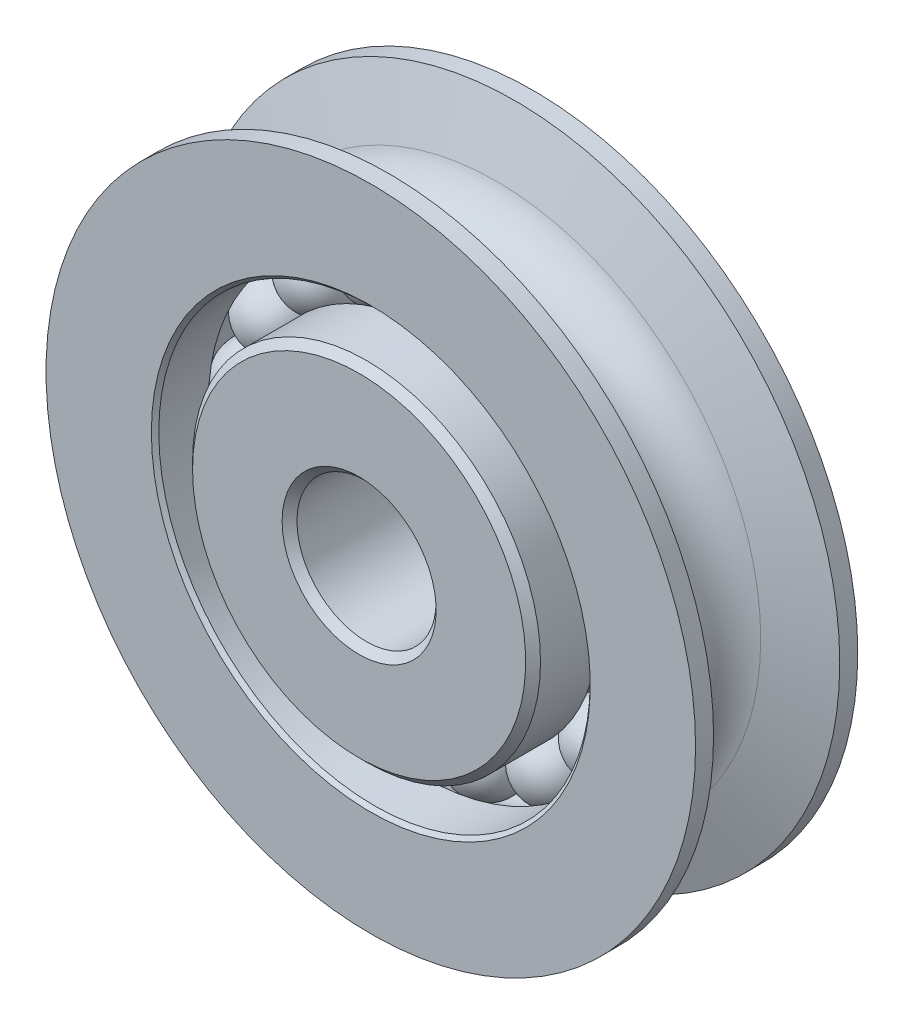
ISO-10303-21;
HEADER;
FILE_DESCRIPTION(('STEP AP214'),'2;1');
FILE_NAME('part.step','',(''),(''),'','','');
FILE_SCHEMA(('AUTOMOTIVE_DESIGN { 1 0 10303 214 1 1 1 1 }'));
ENDSEC;
DATA;
#1=APPLICATION_CONTEXT('core data for automotive mechanical design processes');
#2=APPLICATION_PROTOCOL_DEFINITION('international standard','automotive_design',2000,#1);
#3=PRODUCT_CONTEXT('',#1,'mechanical');
#4=PRODUCT('Part','Part','',(#3));
#5=PRODUCT_RELATED_PRODUCT_CATEGORY('part','',(#4));
#6=PRODUCT_DEFINITION_FORMATION('','',#4);
#7=PRODUCT_DEFINITION_CONTEXT('part definition',#1,'design');
#8=PRODUCT_DEFINITION('design','',#6,#7);
#9=PRODUCT_DEFINITION_SHAPE('','',#8);
#10=(LENGTH_UNIT() NAMED_UNIT(*) SI_UNIT(.MILLI.,.METRE.));
#11=(NAMED_UNIT(*) PLANE_ANGLE_UNIT() SI_UNIT($,.RADIAN.));
#12=(NAMED_UNIT(*) SI_UNIT($,.STERADIAN.) SOLID_ANGLE_UNIT());
#13=UNCERTAINTY_MEASURE_WITH_UNIT(LENGTH_MEASURE(1.E-05),#10,'distance_accuracy_value','');
#14=(GEOMETRIC_REPRESENTATION_CONTEXT(3) GLOBAL_UNCERTAINTY_ASSIGNED_CONTEXT((#13)) GLOBAL_UNIT_ASSIGNED_CONTEXT((#10,
#11,#12)) REPRESENTATION_CONTEXT('',''));
#15=CARTESIAN_POINT('',(0.,0.,0.));
#16=DIRECTION('',(0.,0.,1.));
#17=DIRECTION('',(1.,0.,0.));
#18=AXIS2_PLACEMENT_3D('',#15,#16,#17);
#19=CARTESIAN_POINT('',(4.81715761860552,12.4345171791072,0.));
#20=DIRECTION('',(0.361241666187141,0.932472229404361,0.));
#21=DIRECTION('',(0.,0.,-1.));
#22=AXIS2_PLACEMENT_3D('',#19,#20,#21);
#23=SPHERICAL_SURFACE('',#22,2.38125);
#24=CARTESIAN_POINT('',(5.67736433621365,14.6549666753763,0.));
#25=VERTEX_POINT('',#24);
#26=VERTEX_LOOP('',#25);
#27=FACE_BOUND('',#26,.T.);
#28=ADVANCED_FACE('F145',(#27),#23,.T.);
#29=CLOSED_SHELL('',(#28));
#30=MANIFOLD_SOLID_BREP('B2',#29);
#31=CARTESIAN_POINT('',(8.98373140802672,9.8546839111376,0.));
#32=DIRECTION('',(0.673695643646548,0.739008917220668,0.));
#33=DIRECTION('',(0.,0.,-1.));
#34=AXIS2_PLACEMENT_3D('',#31,#32,#33);
#35=SPHERICAL_SURFACE('',#34,2.38125);
#36=CARTESIAN_POINT('',(10.5879691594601,11.6144488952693,0.));
#37=VERTEX_POINT('',#36);
#38=VERTEX_LOOP('',#37);
#39=FACE_BOUND('',#38,.T.);
#40=ADVANCED_FACE('F163',(#39),#35,.T.);
#41=CLOSED_SHELL('',(#40));
#42=MANIFOLD_SOLID_BREP('B7',#41);
#43=CARTESIAN_POINT('',(11.9370024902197,5.94392097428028,0.));
#44=DIRECTION('',(0.895163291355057,0.445738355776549,0.));
#45=DIRECTION('',(0.,0.,-1.));
#46=AXIS2_PLACEMENT_3D('',#43,#44,#45);
#47=SPHERICAL_SURFACE('',#46,2.38125);
#48=CARTESIAN_POINT('',(14.0686100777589,7.00533543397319,0.));
#49=VERTEX_POINT('',#48);
#50=VERTEX_LOOP('',#49);
#51=FACE_BOUND('',#50,.T.);
#52=ADVANCED_FACE('F181',(#51),#47,.T.);
#53=CLOSED_SHELL('',(#52));
#54=MANIFOLD_SOLID_BREP('B141',#53);
#55=CARTESIAN_POINT('',(13.2781152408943,1.23039857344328,0.));
#56=DIRECTION('',(0.995734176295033,0.092268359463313,0.));
#57=DIRECTION('',(0.,0.,-1.));
#58=AXIS2_PLACEMENT_3D('',#55,#56,#57);
#59=SPHERICAL_SURFACE('',#58,2.38125);
#60=CARTESIAN_POINT('',(15.6492072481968,1.45011260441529,0.));
#61=VERTEX_POINT('',#60);
#62=VERTEX_LOOP('',#61);
#63=FACE_BOUND('',#62,.T.);
#64=ADVANCED_FACE('F199',(#63),#59,.T.);
#65=CLOSED_SHELL('',(#64));
#66=MANIFOLD_SOLID_BREP('B159',#65);
#67=CARTESIAN_POINT('',(12.8259449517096,-3.64929597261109,0.));
#68=DIRECTION('',(0.961825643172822,-0.273662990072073,0.));
#69=DIRECTION('',(0.,0.,-1.));
#70=AXIS2_PLACEMENT_3D('',#67,#68,#69);
#71=SPHERICAL_SURFACE('',#70,2.38125);
#72=CARTESIAN_POINT('',(15.1162922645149,-4.30095596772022,0.));
#73=VERTEX_POINT('',#72);
#74=VERTEX_LOOP('',#73);
#75=FACE_BOUND('',#74,.T.);
#76=ADVANCED_FACE('F217',(#75),#71,.T.);
#77=CLOSED_SHELL('',(#76));
#78=MANIFOLD_SOLID_BREP('B177',#77);
#79=CARTESIAN_POINT('',(10.6415597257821,-8.03613287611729,0.));
#80=DIRECTION('',(0.798017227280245,-0.602634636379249,0.));
#81=DIRECTION('',(0.,0.,-1.));
#82=AXIS2_PLACEMENT_3D('',#79,#80,#81);
#83=SPHERICAL_SURFACE('',#82,2.38125);
#84=CARTESIAN_POINT('',(12.5418382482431,-9.47115660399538,0.));
#85=VERTEX_POINT('',#84);
#86=VERTEX_LOOP('',#85);
#87=FACE_BOUND('',#86,.T.);
#88=ADVANCED_FACE('F235',(#87),#83,.T.);
#89=CLOSED_SHELL('',(#88));
#90=MANIFOLD_SOLID_BREP('B195',#89);
#91=CARTESIAN_POINT('',(7.01997289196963,-11.3376455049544,0.));
#92=DIRECTION('',(0.526432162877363,-0.85021713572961,0.));
#93=DIRECTION('',(0.,0.,-1.));
#94=AXIS2_PLACEMENT_3D('',#91,#92,#93);
#95=SPHERICAL_SURFACE('',#94,2.38125);
#96=CARTESIAN_POINT('',(8.27353947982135,-13.3622250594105,0.));
#97=VERTEX_POINT('',#96);
#98=VERTEX_LOOP('',#97);
#99=FACE_BOUND('',#98,.T.);
#100=ADVANCED_FACE('F253',(#99),#95,.T.);
#101=CLOSED_SHELL('',(#100));
#102=MANIFOLD_SOLID_BREP('B213',#101);
#103=CARTESIAN_POINT('',(2.45029982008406,-13.1079462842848,0.));
#104=DIRECTION('',(0.183749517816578,-0.9829730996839,0.));
#105=DIRECTION('',(0.,0.,-1.));
#106=AXIS2_PLACEMENT_3D('',#103,#104,#105);
#107=SPHERICAL_SURFACE('',#106,2.38125);
#108=CARTESIAN_POINT('',(2.88785335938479,-15.4486509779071,0.));
#109=VERTEX_POINT('',#108);
#110=VERTEX_LOOP('',#109);
#111=FACE_BOUND('',#110,.T.);
#112=ADVANCED_FACE('F271',(#111),#107,.T.);
#113=CLOSED_SHELL('',(#112));
#114=MANIFOLD_SOLID_BREP('B231',#113);
#115=CARTESIAN_POINT('',(-2.45029982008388,-13.1079462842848,0.));
#116=DIRECTION('',(-0.183749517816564,-0.982973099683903,0.));
#117=DIRECTION('',(0.,0.,-1.));
#118=AXIS2_PLACEMENT_3D('',#115,#116,#117);
#119=SPHERICAL_SURFACE('',#118,2.38125);
#120=CARTESIAN_POINT('',(-2.88785335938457,-15.4486509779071,0.));
#121=VERTEX_POINT('',#120);
#122=VERTEX_LOOP('',#121);
#123=FACE_BOUND('',#122,.T.);
#124=ADVANCED_FACE('F289',(#123),#119,.T.);
#125=CLOSED_SHELL('',(#124));
#126=MANIFOLD_SOLID_BREP('B249',#125);
#127=CARTESIAN_POINT('',(-7.01997289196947,-11.3376455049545,0.));
#128=DIRECTION('',(-0.526432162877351,-0.850217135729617,0.));
#129=DIRECTION('',(0.,0.,-1.));
#130=AXIS2_PLACEMENT_3D('',#127,#128,#129);
#131=SPHERICAL_SURFACE('',#130,2.38125);
#132=CARTESIAN_POINT('',(-8.27353947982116,-13.3622250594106,0.));
#133=VERTEX_POINT('',#132);
#134=VERTEX_LOOP('',#133);
#135=FACE_BOUND('',#134,.T.);
#136=ADVANCED_FACE('F307',(#135),#131,.T.);
#137=CLOSED_SHELL('',(#136));
#138=MANIFOLD_SOLID_BREP('B267',#137);
#139=CARTESIAN_POINT('',(-10.641559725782,-8.03613287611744,0.));
#140=DIRECTION('',(-0.798017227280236,-0.602634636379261,0.));
#141=DIRECTION('',(0.,0.,-1.));
#142=AXIS2_PLACEMENT_3D('',#139,#140,#141);
#143=SPHERICAL_SURFACE('',#142,2.38125);
#144=CARTESIAN_POINT('',(-12.541838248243,-9.47115660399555,0.));
#145=VERTEX_POINT('',#144);
#146=VERTEX_LOOP('',#145);
#147=FACE_BOUND('',#146,.T.);
#148=ADVANCED_FACE('F325',(#147),#143,.T.);
#149=CLOSED_SHELL('',(#148));
#150=MANIFOLD_SOLID_BREP('B285',#149);
#151=CARTESIAN_POINT('',(-12.8259449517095,-3.64929597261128,0.));
#152=DIRECTION('',(-0.961825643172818,-0.273662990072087,0.));
#153=DIRECTION('',(0.,0.,-1.));
#154=AXIS2_PLACEMENT_3D('',#151,#152,#153);
#155=SPHERICAL_SURFACE('',#154,2.38125);
#156=CARTESIAN_POINT('',(-15.1162922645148,-4.30095596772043,0.));
#157=VERTEX_POINT('',#156);
#158=VERTEX_LOOP('',#157);
#159=FACE_BOUND('',#158,.T.);
#160=ADVANCED_FACE('F343',(#159),#155,.T.);
#161=CLOSED_SHELL('',(#160));
#162=MANIFOLD_SOLID_BREP('B303',#161);
#163=CARTESIAN_POINT('',(-13.2781152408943,1.23039857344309,0.));
#164=DIRECTION('',(-0.995734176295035,0.0922683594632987,0.));
#165=DIRECTION('',(0.,0.,-1.));
#166=AXIS2_PLACEMENT_3D('',#163,#164,#165);
#167=SPHERICAL_SURFACE('',#166,2.38125);
#168=CARTESIAN_POINT('',(-15.6492072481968,1.45011260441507,0.));
#169=VERTEX_POINT('',#168);
#170=VERTEX_LOOP('',#169);
#171=FACE_BOUND('',#170,.T.);
#172=ADVANCED_FACE('F361',(#171),#167,.T.);
#173=CLOSED_SHELL('',(#172));
#174=MANIFOLD_SOLID_BREP('B321',#173);
#175=CARTESIAN_POINT('',(-11.9370024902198,5.94392097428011,0.));
#176=DIRECTION('',(-0.895163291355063,0.445738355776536,0.));
#177=DIRECTION('',(0.,0.,-1.));
#178=AXIS2_PLACEMENT_3D('',#175,#176,#177);
#179=SPHERICAL_SURFACE('',#178,2.38125);
#180=CARTESIAN_POINT('',(-14.068610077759,7.00533543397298,0.));
#181=VERTEX_POINT('',#180);
#182=VERTEX_LOOP('',#181);
#183=FACE_BOUND('',#182,.T.);
#184=ADVANCED_FACE('F379',(#183),#179,.T.);
#185=CLOSED_SHELL('',(#184));
#186=MANIFOLD_SOLID_BREP('B339',#185);
#187=CARTESIAN_POINT('',(-8.98373140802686,9.85468391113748,0.));
#188=DIRECTION('',(-0.673695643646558,0.739008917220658,0.));
#189=DIRECTION('',(0.,0.,-1.));
#190=AXIS2_PLACEMENT_3D('',#187,#188,#189);
#191=SPHERICAL_SURFACE('',#190,2.38125);
#192=CARTESIAN_POINT('',(-10.5879691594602,11.6144488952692,0.));
#193=VERTEX_POINT('',#192);
#194=VERTEX_LOOP('',#193);
#195=FACE_BOUND('',#194,.T.);
#196=ADVANCED_FACE('F397',(#195),#191,.T.);
#197=CLOSED_SHELL('',(#196));
#198=MANIFOLD_SOLID_BREP('B357',#197);
#199=CARTESIAN_POINT('',(-4.8171576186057,12.4345171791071,0.));
#200=DIRECTION('',(-0.361241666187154,0.932472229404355,0.));
#201=DIRECTION('',(0.,0.,-1.));
#202=AXIS2_PLACEMENT_3D('',#199,#200,#201);
#203=SPHERICAL_SURFACE('',#202,2.38125);
#204=CARTESIAN_POINT('',(-5.67736433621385,14.6549666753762,0.));
#205=VERTEX_POINT('',#204);
#206=VERTEX_LOOP('',#205);
#207=FACE_BOUND('',#206,.T.);
#208=ADVANCED_FACE('F415',(#207),#203,.T.);
#209=CLOSED_SHELL('',(#208));
#210=MANIFOLD_SOLID_BREP('B375',#209);
#211=CARTESIAN_POINT('',(0.,13.335,0.));
#212=DIRECTION('',(0.,1.,0.));
#213=DIRECTION('',(0.,0.,-1.));
#214=AXIS2_PLACEMENT_3D('',#211,#212,#213);
#215=SPHERICAL_SURFACE('',#214,2.38125);
#216=CARTESIAN_POINT('',(0.,15.71625,0.));
#217=VERTEX_POINT('',#216);
#218=VERTEX_LOOP('',#217);
#219=FACE_BOUND('',#218,.T.);
#220=ADVANCED_FACE('F435',(#219),#215,.T.);
#221=CLOSED_SHELL('',(#220));
#222=MANIFOLD_SOLID_BREP('B393',#221);
#223=CARTESIAN_POINT('',(0.,11.90625,6.35));
#224=DIRECTION('',(0.,0.,-1.));
#225=DIRECTION('',(-1.,0.,0.));
#226=AXIS2_PLACEMENT_3D('',#223,#224,#225);
#227=PLANE('',#226);
#228=CARTESIAN_POINT('',(0.,0.,6.35));
#229=DIRECTION('',(0.,0.,-1.));
#230=DIRECTION('',(-1.,0.,0.));
#231=AXIS2_PLACEMENT_3D('',#228,#229,#230);
#232=CIRCLE('',#231,11.39825);
#233=CARTESIAN_POINT('',(-11.39825,0.,6.35));
#234=VERTEX_POINT('',#233);
#235=EDGE_CURVE('E461',#234,#234,#232,.F.);
#236=ORIENTED_EDGE('',*,*,#235,.T.);
#237=EDGE_LOOP('',(#236));
#238=FACE_BOUND('',#237,.T.);
#239=CARTESIAN_POINT('',(0.,0.,6.35));
#240=DIRECTION('',(0.,0.,-1.));
#241=DIRECTION('',(-1.,0.,0.));
#242=AXIS2_PLACEMENT_3D('',#239,#240,#241);
#243=CIRCLE('',#242,5.2705);
#244=CARTESIAN_POINT('',(-5.2705,0.,6.35));
#245=VERTEX_POINT('',#244);
#246=EDGE_CURVE('E465',#245,#245,#243,.T.);
#247=ORIENTED_EDGE('',*,*,#246,.T.);
#248=EDGE_LOOP('',(#247));
#249=FACE_BOUND('',#248,.T.);
#250=ADVANCED_FACE('F454',(#238,#249),#227,.F.);
#251=CARTESIAN_POINT('',(0.,0.,6.35));
#252=DIRECTION('',(0.,0.,1.));
#253=DIRECTION('',(1.,0.,0.));
#254=AXIS2_PLACEMENT_3D('',#251,#252,#253);
#255=CYLINDRICAL_SURFACE('',#254,4.7625);
#256=CARTESIAN_POINT('',(0.,0.,-5.842));
#257=DIRECTION('',(0.,0.,1.));
#258=DIRECTION('',(1.,0.,0.));
#259=AXIS2_PLACEMENT_3D('',#256,#257,#258);
#260=CIRCLE('',#259,4.7625);
#261=CARTESIAN_POINT('',(4.7625,0.,-5.842));
#262=VERTEX_POINT('',#261);
#263=EDGE_CURVE('E474',#262,#262,#260,.F.);
#264=ORIENTED_EDGE('',*,*,#263,.T.);
#265=EDGE_LOOP('',(#264));
#266=FACE_BOUND('',#265,.T.);
#267=CARTESIAN_POINT('',(0.,0.,5.842));
#268=DIRECTION('',(0.,0.,-1.));
#269=DIRECTION('',(-1.,0.,0.));
#270=AXIS2_PLACEMENT_3D('',#267,#268,#269);
#271=CIRCLE('',#270,4.7625);
#272=CARTESIAN_POINT('',(-4.7625,0.,5.842));
#273=VERTEX_POINT('',#272);
#274=EDGE_CURVE('E477',#273,#273,#271,.F.);
#275=ORIENTED_EDGE('',*,*,#274,.T.);
#276=EDGE_LOOP('',(#275));
#277=FACE_BOUND('',#276,.T.);
#278=ADVANCED_FACE('F509',(#266,#277),#255,.F.);
#279=CARTESIAN_POINT('',(0.,11.90625,-6.35));
#280=DIRECTION('',(0.,0.,1.));
#281=DIRECTION('',(1.,0.,0.));
#282=AXIS2_PLACEMENT_3D('',#279,#280,#281);
#283=PLANE('',#282);
#284=CARTESIAN_POINT('',(0.,0.,-6.35));
#285=DIRECTION('',(0.,0.,1.));
#286=DIRECTION('',(1.,0.,0.));
#287=AXIS2_PLACEMENT_3D('',#284,#285,#286);
#288=CIRCLE('',#287,5.2705);
#289=CARTESIAN_POINT('',(5.2705,0.,-6.35));
#290=VERTEX_POINT('',#289);
#291=EDGE_CURVE('E480',#290,#290,#288,.T.);
#292=ORIENTED_EDGE('',*,*,#291,.T.);
#293=EDGE_LOOP('',(#292));
#294=FACE_BOUND('',#293,.T.);
#295=CARTESIAN_POINT('',(0.,0.,-6.35));
#296=DIRECTION('',(0.,0.,1.));
#297=DIRECTION('',(1.,0.,0.));
#298=AXIS2_PLACEMENT_3D('',#295,#296,#297);
#299=CIRCLE('',#298,11.39825);
#300=CARTESIAN_POINT('',(11.39825,0.,-6.35));
#301=VERTEX_POINT('',#300);
#302=EDGE_CURVE('E483',#301,#301,#299,.F.);
#303=ORIENTED_EDGE('',*,*,#302,.T.);
#304=EDGE_LOOP('',(#303));
#305=FACE_BOUND('',#304,.T.);
#306=ADVANCED_FACE('F503',(#294,#305),#283,.F.);
#307=CARTESIAN_POINT('',(0.,0.,6.35));
#308=DIRECTION('',(0.,0.,1.));
#309=DIRECTION('',(1.,0.,0.));
#310=AXIS2_PLACEMENT_3D('',#307,#308,#309);
#311=CYLINDRICAL_SURFACE('',#310,11.90625);
#312=CARTESIAN_POINT('',(0.,0.,-5.842));
#313=DIRECTION('',(0.,0.,1.));
#314=DIRECTION('',(1.,0.,0.));
#315=AXIS2_PLACEMENT_3D('',#312,#313,#314);
#316=CIRCLE('',#315,11.90625);
#317=CARTESIAN_POINT('',(11.90625,0.,-5.842));
#318=VERTEX_POINT('',#317);
#319=EDGE_CURVE('E469',#318,#318,#316,.T.);
#320=ORIENTED_EDGE('',*,*,#319,.T.);
#321=EDGE_LOOP('',(#320));
#322=FACE_BOUND('',#321,.T.);
#323=CARTESIAN_POINT('',(0.,0.,-1.905));
#324=DIRECTION('',(0.,0.,1.));
#325=DIRECTION('',(1.,0.,0.));
#326=AXIS2_PLACEMENT_3D('',#323,#324,#325);
#327=CIRCLE('',#326,11.90625);
#328=CARTESIAN_POINT('',(11.90625,0.,-1.905));
#329=VERTEX_POINT('',#328);
#330=EDGE_CURVE('E486',#329,#329,#327,.T.);
#331=ORIENTED_EDGE('',*,*,#330,.F.);
#332=EDGE_LOOP('',(#331));
#333=FACE_BOUND('',#332,.T.);
#334=ADVANCED_FACE('F498',(#322,#333),#311,.T.);
#335=CARTESIAN_POINT('',(0.,0.,0.));
#336=DIRECTION('',(0.,0.,1.));
#337=DIRECTION('',(1.,0.,0.));
#338=AXIS2_PLACEMENT_3D('',#335,#336,#337);
#339=TOROIDAL_SURFACE('',#338,13.335,2.38125);
#340=CARTESIAN_POINT('',(0.,0.,1.905));
#341=DIRECTION('',(0.,0.,1.));
#342=DIRECTION('',(1.,0.,0.));
#343=AXIS2_PLACEMENT_3D('',#340,#341,#342);
#344=CIRCLE('',#343,11.90625);
#345=CARTESIAN_POINT('',(11.90625,0.,1.905));
#346=VERTEX_POINT('',#345);
#347=EDGE_CURVE('E489',#346,#346,#344,.T.);
#348=ORIENTED_EDGE('',*,*,#347,.F.);
#349=EDGE_LOOP('',(#348));
#350=FACE_BOUND('',#349,.T.);
#351=ORIENTED_EDGE('',*,*,#330,.T.);
#352=EDGE_LOOP('',(#351));
#353=FACE_BOUND('',#352,.T.);
#354=ADVANCED_FACE('F495',(#350,#353),#339,.F.);
#355=CARTESIAN_POINT('',(0.,0.,6.35));
#356=DIRECTION('',(0.,0.,1.));
#357=DIRECTION('',(1.,0.,0.));
#358=AXIS2_PLACEMENT_3D('',#355,#356,#357);
#359=CYLINDRICAL_SURFACE('',#358,11.90625);
#360=CARTESIAN_POINT('',(0.,0.,5.84199999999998));
#361=DIRECTION('',(0.,0.,-1.));
#362=DIRECTION('',(-1.,0.,0.));
#363=AXIS2_PLACEMENT_3D('',#360,#361,#362);
#364=CIRCLE('',#363,11.90625);
#365=CARTESIAN_POINT('',(-11.90625,0.,5.84199999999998));
#366=VERTEX_POINT('',#365);
#367=EDGE_CURVE('E434',#366,#366,#364,.T.);
#368=ORIENTED_EDGE('',*,*,#367,.T.);
#369=EDGE_LOOP('',(#368));
#370=FACE_BOUND('',#369,.T.);
#371=ORIENTED_EDGE('',*,*,#347,.T.);
#372=EDGE_LOOP('',(#371));
#373=FACE_BOUND('',#372,.T.);
#374=ADVANCED_FACE('F493',(#370,#373),#359,.T.);
#375=CARTESIAN_POINT('',(0.,0.,-6.35));
#376=DIRECTION('',(0.,0.,-1.));
#377=DIRECTION('',(-1.,0.,0.));
#378=AXIS2_PLACEMENT_3D('',#375,#376,#377);
#379=CONICAL_SURFACE('',#378,5.2705,0.785398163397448);
#380=ORIENTED_EDGE('',*,*,#263,.F.);
#381=EDGE_LOOP('',(#380));
#382=FACE_BOUND('',#381,.T.);
#383=ORIENTED_EDGE('',*,*,#291,.F.);
#384=EDGE_LOOP('',(#383));
#385=FACE_BOUND('',#384,.T.);
#386=ADVANCED_FACE('F521',(#382,#385),#379,.F.);
#387=CARTESIAN_POINT('',(0.,0.,-5.842));
#388=DIRECTION('',(0.,0.,1.));
#389=DIRECTION('',(1.,0.,0.));
#390=AXIS2_PLACEMENT_3D('',#387,#388,#389);
#391=CONICAL_SURFACE('',#390,11.90625,0.785398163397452);
#392=ORIENTED_EDGE('',*,*,#302,.F.);
#393=EDGE_LOOP('',(#392));
#394=FACE_BOUND('',#393,.T.);
#395=ORIENTED_EDGE('',*,*,#319,.F.);
#396=EDGE_LOOP('',(#395));
#397=FACE_BOUND('',#396,.T.);
#398=ADVANCED_FACE('F524',(#394,#397),#391,.T.);
#399=CARTESIAN_POINT('',(0.,0.,6.35));
#400=DIRECTION('',(0.,0.,-1.));
#401=DIRECTION('',(-1.,0.,0.));
#402=AXIS2_PLACEMENT_3D('',#399,#400,#401);
#403=CONICAL_SURFACE('',#402,11.39825,0.785398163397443);
#404=ORIENTED_EDGE('',*,*,#367,.F.);
#405=EDGE_LOOP('',(#404));
#406=FACE_BOUND('',#405,.T.);
#407=ORIENTED_EDGE('',*,*,#235,.F.);
#408=EDGE_LOOP('',(#407));
#409=FACE_BOUND('',#408,.T.);
#410=ADVANCED_FACE('F527',(#406,#409),#403,.T.);
#411=CARTESIAN_POINT('',(0.,0.,5.842));
#412=DIRECTION('',(0.,0.,1.));
#413=DIRECTION('',(1.,0.,0.));
#414=AXIS2_PLACEMENT_3D('',#411,#412,#413);
#415=CONICAL_SURFACE('',#414,4.7625,0.785398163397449);
#416=ORIENTED_EDGE('',*,*,#246,.F.);
#417=EDGE_LOOP('',(#416));
#418=FACE_BOUND('',#417,.T.);
#419=ORIENTED_EDGE('',*,*,#274,.F.);
#420=EDGE_LOOP('',(#419));
#421=FACE_BOUND('',#420,.T.);
#422=ADVANCED_FACE('F456',(#418,#421),#415,.F.);
#423=CLOSED_SHELL('',(#250,#278,#306,#334,#354,#374,#386,#398,#410,#422));
#424=MANIFOLD_SOLID_BREP('B411',#423);
#425=CARTESIAN_POINT('',(0.,0.,0.));
#426=DIRECTION('',(0.,0.,1.));
#427=DIRECTION('',(1.,0.,0.));
#428=AXIS2_PLACEMENT_3D('',#425,#426,#427);
#429=TOROIDAL_SURFACE('',#428,19.05,3.175);
#430=CARTESIAN_POINT('',(0.,0.,3.03060078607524));
#431=DIRECTION('',(0.,0.,1.));
#432=DIRECTION('',(1.,0.,0.));
#433=AXIS2_PLACEMENT_3D('',#430,#431,#432);
#434=CIRCLE('',#433,18.1033829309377);
#435=CARTESIAN_POINT('',(18.1033829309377,0.,3.03060078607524));
#436=VERTEX_POINT('',#435);
#437=EDGE_CURVE('E625',#436,#436,#434,.T.);
#438=ORIENTED_EDGE('',*,*,#437,.F.);
#439=EDGE_LOOP('',(#438));
#440=FACE_BOUND('',#439,.T.);
#441=CARTESIAN_POINT('',(0.,0.,-3.03060078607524));
#442=DIRECTION('',(0.,0.,1.));
#443=DIRECTION('',(1.,0.,0.));
#444=AXIS2_PLACEMENT_3D('',#441,#442,#443);
#445=CIRCLE('',#444,18.1033829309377);
#446=CARTESIAN_POINT('',(18.1033829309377,0.,-3.03060078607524));
#447=VERTEX_POINT('',#446);
#448=EDGE_CURVE('E646',#447,#447,#445,.T.);
#449=ORIENTED_EDGE('',*,*,#448,.T.);
#450=EDGE_LOOP('',(#449));
#451=FACE_BOUND('',#450,.T.);
#452=ADVANCED_FACE('F605',(#440,#451),#429,.F.);
#453=CARTESIAN_POINT('',(0.,0.,3.03060078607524));
#454=DIRECTION('',(0.,0.,1.));
#455=DIRECTION('',(1.,0.,0.));
#456=AXIS2_PLACEMENT_3D('',#453,#454,#455);
#457=CONICAL_SURFACE('',#456,18.1033829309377,1.26804543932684);
#458=CARTESIAN_POINT('',(0.,0.,4.318));
#459=DIRECTION('',(0.,0.,1.));
#460=DIRECTION('',(1.,0.,0.));
#461=AXIS2_PLACEMENT_3D('',#458,#459,#460);
#462=CIRCLE('',#461,22.225);
#463=CARTESIAN_POINT('',(22.225,0.,4.318));
#464=VERTEX_POINT('',#463);
#465=EDGE_CURVE('E628',#464,#464,#462,.T.);
#466=ORIENTED_EDGE('',*,*,#465,.F.);
#467=EDGE_LOOP('',(#466));
#468=FACE_BOUND('',#467,.T.);
#469=ORIENTED_EDGE('',*,*,#437,.T.);
#470=EDGE_LOOP('',(#469));
#471=FACE_BOUND('',#470,.T.);
#472=ADVANCED_FACE('F676',(#468,#471),#457,.T.);
#473=CARTESIAN_POINT('',(0.,0.,6.35));
#474=DIRECTION('',(0.,0.,1.));
#475=DIRECTION('',(1.,0.,0.));
#476=AXIS2_PLACEMENT_3D('',#473,#474,#475);
#477=CYLINDRICAL_SURFACE('',#476,22.225);
#478=CARTESIAN_POINT('',(0.,0.,5.5499));
#479=DIRECTION('',(0.,0.,1.));
#480=DIRECTION('',(1.,0.,0.));
#481=AXIS2_PLACEMENT_3D('',#478,#479,#480);
#482=CIRCLE('',#481,22.225);
#483=CARTESIAN_POINT('',(22.225,0.,5.5499));
#484=VERTEX_POINT('',#483);
#485=EDGE_CURVE('E631',#484,#484,#482,.T.);
#486=ORIENTED_EDGE('',*,*,#485,.F.);
#487=EDGE_LOOP('',(#486));
#488=FACE_BOUND('',#487,.T.);
#489=ORIENTED_EDGE('',*,*,#465,.T.);
#490=EDGE_LOOP('',(#489));
#491=FACE_BOUND('',#490,.T.);
#492=ADVANCED_FACE('F682',(#488,#491),#477,.T.);
#493=CARTESIAN_POINT('',(0.,14.76375,5.5499));
#494=DIRECTION('',(0.,0.,-1.));
#495=DIRECTION('',(-1.,0.,0.));
#496=AXIS2_PLACEMENT_3D('',#493,#494,#495);
#497=PLANE('',#496);
#498=CARTESIAN_POINT('',(0.,0.,5.5499));
#499=DIRECTION('',(0.,0.,-1.));
#500=DIRECTION('',(-1.,0.,0.));
#501=AXIS2_PLACEMENT_3D('',#498,#499,#500);
#502=CIRCLE('',#501,15.01775);
#503=CARTESIAN_POINT('',(-15.01775,0.,5.5499));
#504=VERTEX_POINT('',#503);
#505=EDGE_CURVE('E453',#504,#504,#502,.T.);
#506=ORIENTED_EDGE('',*,*,#505,.T.);
#507=EDGE_LOOP('',(#506));
#508=FACE_BOUND('',#507,.T.);
#509=ORIENTED_EDGE('',*,*,#485,.T.);
#510=EDGE_LOOP('',(#509));
#511=FACE_BOUND('',#510,.T.);
#512=ADVANCED_FACE('F706',(#508,#511),#497,.F.);
#513=CARTESIAN_POINT('',(0.,0.,6.35));
#514=DIRECTION('',(0.,0.,1.));
#515=DIRECTION('',(1.,0.,0.));
#516=AXIS2_PLACEMENT_3D('',#513,#514,#515);
#517=CYLINDRICAL_SURFACE('',#516,14.76375);
#518=CARTESIAN_POINT('',(0.,0.,5.29589999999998));
#519=DIRECTION('',(0.,0.,-1.));
#520=DIRECTION('',(-1.,0.,0.));
#521=AXIS2_PLACEMENT_3D('',#518,#519,#520);
#522=CIRCLE('',#521,14.76375);
#523=CARTESIAN_POINT('',(-14.76375,0.,5.29589999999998));
#524=VERTEX_POINT('',#523);
#525=EDGE_CURVE('E612',#524,#524,#522,.F.);
#526=ORIENTED_EDGE('',*,*,#525,.T.);
#527=EDGE_LOOP('',(#526));
#528=FACE_BOUND('',#527,.T.);
#529=CARTESIAN_POINT('',(0.,0.,1.905));
#530=DIRECTION('',(0.,0.,1.));
#531=DIRECTION('',(1.,0.,0.));
#532=AXIS2_PLACEMENT_3D('',#529,#530,#531);
#533=CIRCLE('',#532,14.76375);
#534=CARTESIAN_POINT('',(14.76375,0.,1.905));
#535=VERTEX_POINT('',#534);
#536=EDGE_CURVE('E634',#535,#535,#533,.T.);
#537=ORIENTED_EDGE('',*,*,#536,.F.);
#538=EDGE_LOOP('',(#537));
#539=FACE_BOUND('',#538,.T.);
#540=ADVANCED_FACE('F701',(#528,#539),#517,.F.);
#541=CARTESIAN_POINT('',(0.,0.,0.));
#542=DIRECTION('',(0.,0.,1.));
#543=DIRECTION('',(1.,0.,0.));
#544=AXIS2_PLACEMENT_3D('',#541,#542,#543);
#545=TOROIDAL_SURFACE('',#544,13.335,2.38125);
#546=CARTESIAN_POINT('',(0.,0.,-1.905));
#547=DIRECTION('',(0.,0.,1.));
#548=DIRECTION('',(1.,0.,0.));
#549=AXIS2_PLACEMENT_3D('',#546,#547,#548);
#550=CIRCLE('',#549,14.76375);
#551=CARTESIAN_POINT('',(14.76375,0.,-1.905));
#552=VERTEX_POINT('',#551);
#553=EDGE_CURVE('E637',#552,#552,#550,.T.);
#554=ORIENTED_EDGE('',*,*,#553,.F.);
#555=EDGE_LOOP('',(#554));
#556=FACE_BOUND('',#555,.T.);
#557=ORIENTED_EDGE('',*,*,#536,.T.);
#558=EDGE_LOOP('',(#557));
#559=FACE_BOUND('',#558,.T.);
#560=ADVANCED_FACE('F672',(#556,#559),#545,.F.);
#561=CARTESIAN_POINT('',(0.,0.,6.35));
#562=DIRECTION('',(0.,0.,1.));
#563=DIRECTION('',(1.,0.,0.));
#564=AXIS2_PLACEMENT_3D('',#561,#562,#563);
#565=CYLINDRICAL_SURFACE('',#564,14.76375);
#566=CARTESIAN_POINT('',(0.,0.,-5.2959));
#567=DIRECTION('',(0.,0.,1.));
#568=DIRECTION('',(1.,0.,0.));
#569=AXIS2_PLACEMENT_3D('',#566,#567,#568);
#570=CIRCLE('',#569,14.76375);
#571=CARTESIAN_POINT('',(14.76375,0.,-5.2959));
#572=VERTEX_POINT('',#571);
#573=EDGE_CURVE('E616',#572,#572,#570,.F.);
#574=ORIENTED_EDGE('',*,*,#573,.T.);
#575=EDGE_LOOP('',(#574));
#576=FACE_BOUND('',#575,.T.);
#577=ORIENTED_EDGE('',*,*,#553,.T.);
#578=EDGE_LOOP('',(#577));
#579=FACE_BOUND('',#578,.T.);
#580=ADVANCED_FACE('F666',(#576,#579),#565,.F.);
#581=CARTESIAN_POINT('',(0.,22.225,-5.5499));
#582=DIRECTION('',(0.,0.,1.));
#583=DIRECTION('',(1.,0.,0.));
#584=AXIS2_PLACEMENT_3D('',#581,#582,#583);
#585=PLANE('',#584);
#586=CARTESIAN_POINT('',(0.,0.,-5.5499));
#587=DIRECTION('',(0.,0.,1.));
#588=DIRECTION('',(1.,0.,0.));
#589=AXIS2_PLACEMENT_3D('',#586,#587,#588);
#590=CIRCLE('',#589,15.01775);
#591=CARTESIAN_POINT('',(15.01775,0.,-5.5499));
#592=VERTEX_POINT('',#591);
#593=EDGE_CURVE('E620',#592,#592,#590,.T.);
#594=ORIENTED_EDGE('',*,*,#593,.T.);
#595=EDGE_LOOP('',(#594));
#596=FACE_BOUND('',#595,.T.);
#597=CARTESIAN_POINT('',(0.,0.,-5.5499));
#598=DIRECTION('',(0.,0.,1.));
#599=DIRECTION('',(1.,0.,0.));
#600=AXIS2_PLACEMENT_3D('',#597,#598,#599);
#601=CIRCLE('',#600,22.225);
#602=CARTESIAN_POINT('',(22.225,0.,-5.5499));
#603=VERTEX_POINT('',#602);
#604=EDGE_CURVE('E640',#603,#603,#601,.T.);
#605=ORIENTED_EDGE('',*,*,#604,.F.);
#606=EDGE_LOOP('',(#605));
#607=FACE_BOUND('',#606,.T.);
#608=ADVANCED_FACE('F661',(#596,#607),#585,.F.);
#609=CARTESIAN_POINT('',(0.,0.,6.35));
#610=DIRECTION('',(0.,0.,1.));
#611=DIRECTION('',(1.,0.,0.));
#612=AXIS2_PLACEMENT_3D('',#609,#610,#611);
#613=CYLINDRICAL_SURFACE('',#612,22.225);
#614=CARTESIAN_POINT('',(0.,0.,-4.318));
#615=DIRECTION('',(0.,0.,1.));
#616=DIRECTION('',(1.,0.,0.));
#617=AXIS2_PLACEMENT_3D('',#614,#615,#616);
#618=CIRCLE('',#617,22.225);
#619=CARTESIAN_POINT('',(22.225,0.,-4.318));
#620=VERTEX_POINT('',#619);
#621=EDGE_CURVE('E643',#620,#620,#618,.T.);
#622=ORIENTED_EDGE('',*,*,#621,.F.);
#623=EDGE_LOOP('',(#622));
#624=FACE_BOUND('',#623,.T.);
#625=ORIENTED_EDGE('',*,*,#604,.T.);
#626=EDGE_LOOP('',(#625));
#627=FACE_BOUND('',#626,.T.);
#628=ADVANCED_FACE('F655',(#624,#627),#613,.T.);
#629=CARTESIAN_POINT('',(0.,0.,-4.318));
#630=DIRECTION('',(0.,0.,-1.));
#631=DIRECTION('',(-1.,0.,0.));
#632=AXIS2_PLACEMENT_3D('',#629,#630,#631);
#633=CONICAL_SURFACE('',#632,22.225,1.26804543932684);
#634=ORIENTED_EDGE('',*,*,#448,.F.);
#635=EDGE_LOOP('',(#634));
#636=FACE_BOUND('',#635,.T.);
#637=ORIENTED_EDGE('',*,*,#621,.T.);
#638=EDGE_LOOP('',(#637));
#639=FACE_BOUND('',#638,.T.);
#640=ADVANCED_FACE('F651',(#636,#639),#633,.T.);
#641=CARTESIAN_POINT('',(0.,0.,-5.5499));
#642=DIRECTION('',(0.,0.,-1.));
#643=DIRECTION('',(-1.,0.,0.));
#644=AXIS2_PLACEMENT_3D('',#641,#642,#643);
#645=CONICAL_SURFACE('',#644,15.01775,0.785398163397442);
#646=ORIENTED_EDGE('',*,*,#573,.F.);
#647=EDGE_LOOP('',(#646));
#648=FACE_BOUND('',#647,.T.);
#649=ORIENTED_EDGE('',*,*,#593,.F.);
#650=EDGE_LOOP('',(#649));
#651=FACE_BOUND('',#650,.T.);
#652=ADVANCED_FACE('F654',(#648,#651),#645,.F.);
#653=CARTESIAN_POINT('',(0.,0.,5.29589999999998));
#654=DIRECTION('',(0.,0.,1.));
#655=DIRECTION('',(1.,0.,0.));
#656=AXIS2_PLACEMENT_3D('',#653,#654,#655);
#657=CONICAL_SURFACE('',#656,14.76375,0.785398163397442);
#658=ORIENTED_EDGE('',*,*,#505,.F.);
#659=EDGE_LOOP('',(#658));
#660=FACE_BOUND('',#659,.T.);
#661=ORIENTED_EDGE('',*,*,#525,.F.);
#662=EDGE_LOOP('',(#661));
#663=FACE_BOUND('',#662,.T.);
#664=ADVANCED_FACE('F607',(#660,#663),#657,.F.);
#665=CLOSED_SHELL('',(#452,#472,#492,#512,#540,#560,#580,#608,#628,#640,#652,#664));
#666=MANIFOLD_SOLID_BREP('B429',#665);
#667=ADVANCED_BREP_SHAPE_REPRESENTATION('',(#18,#30,#42,#54,#66,#78,#90,#102,#114,#126,#138,
#150,#162,#174,#186,#198,#210,#222,#424,#666),#14);
#668=SHAPE_DEFINITION_REPRESENTATION(#9,#667);
ENDSEC;
END-ISO-10303-21;
